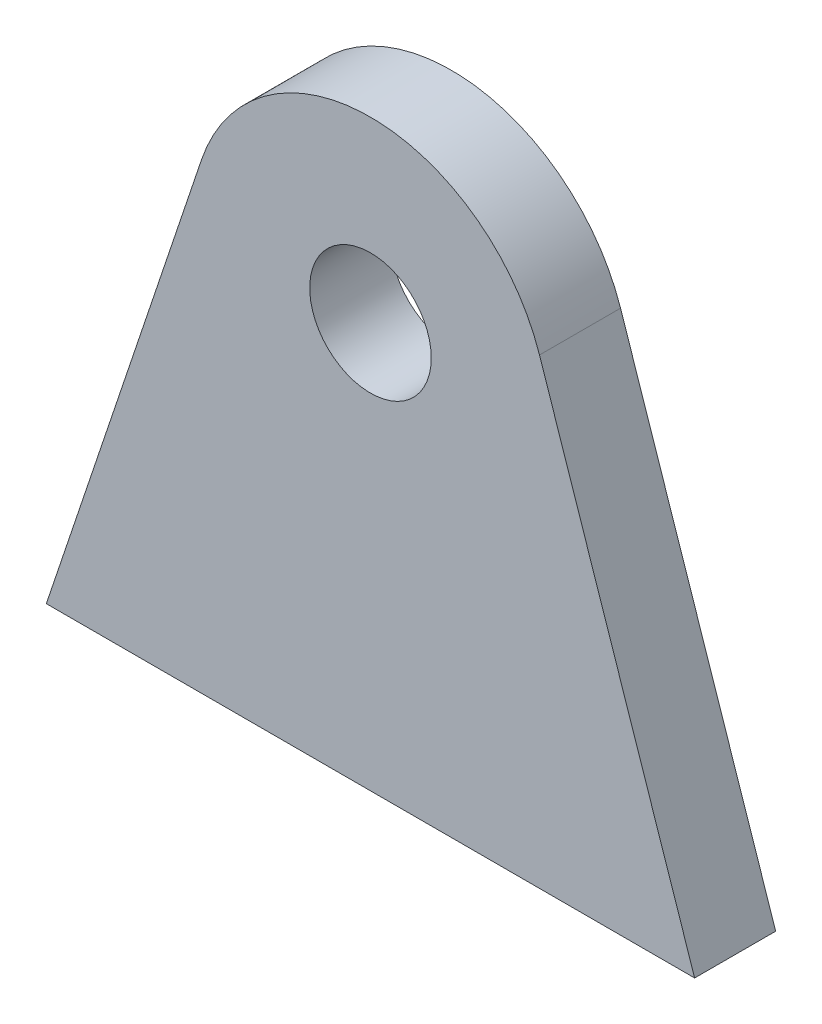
ISO-10303-21;
HEADER;
FILE_DESCRIPTION(('STEP AP214'),'2;1');
FILE_NAME('part.step','',(''),(''),'','','');
FILE_SCHEMA(('AUTOMOTIVE_DESIGN { 1 0 10303 214 1 1 1 1 }'));
ENDSEC;
DATA;
#1=APPLICATION_CONTEXT('core data for automotive mechanical design processes');
#2=APPLICATION_PROTOCOL_DEFINITION('international standard','automotive_design',2000,#1);
#3=PRODUCT_CONTEXT('',#1,'mechanical');
#4=PRODUCT('Part','Part','',(#3));
#5=PRODUCT_RELATED_PRODUCT_CATEGORY('part','',(#4));
#6=PRODUCT_DEFINITION_FORMATION('','',#4);
#7=PRODUCT_DEFINITION_CONTEXT('part definition',#1,'design');
#8=PRODUCT_DEFINITION('design','',#6,#7);
#9=PRODUCT_DEFINITION_SHAPE('','',#8);
#10=(LENGTH_UNIT() NAMED_UNIT(*) SI_UNIT(.MILLI.,.METRE.));
#11=(NAMED_UNIT(*) PLANE_ANGLE_UNIT() SI_UNIT($,.RADIAN.));
#12=(NAMED_UNIT(*) SI_UNIT($,.STERADIAN.) SOLID_ANGLE_UNIT());
#13=UNCERTAINTY_MEASURE_WITH_UNIT(LENGTH_MEASURE(1.E-05),#10,'distance_accuracy_value','');
#14=(GEOMETRIC_REPRESENTATION_CONTEXT(3) GLOBAL_UNCERTAINTY_ASSIGNED_CONTEXT((#13)) GLOBAL_UNIT_ASSIGNED_CONTEXT((#10,
#11,#12)) REPRESENTATION_CONTEXT('',''));
#15=CARTESIAN_POINT('',(0.,0.,0.));
#16=DIRECTION('',(0.,0.,1.));
#17=DIRECTION('',(1.,0.,0.));
#18=AXIS2_PLACEMENT_3D('',#15,#16,#17);
#19=CARTESIAN_POINT('',(25.4,31.75,6.35));
#20=DIRECTION('',(0.,0.,-1.));
#21=DIRECTION('',(-1.,0.,0.));
#22=AXIS2_PLACEMENT_3D('',#19,#20,#21);
#23=PLANE('',#22);
#24=DIRECTION('',(1.,0.,0.));
#25=VECTOR('',#24,1.);
#26=CARTESIAN_POINT('',(50.8,0.,6.35));
#27=LINE('',#26,#25);
#28=CARTESIAN_POINT('',(0.,0.,6.35));
#29=VERTEX_POINT('',#28);
#30=CARTESIAN_POINT('',(50.8,0.,6.35));
#31=VERTEX_POINT('',#30);
#32=EDGE_CURVE('E84',#29,#31,#27,.T.);
#33=ORIENTED_EDGE('',*,*,#32,.T.);
#34=DIRECTION('',(-0.31837254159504,0.9479656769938,0.));
#35=VECTOR('',#34,1.);
#36=CARTESIAN_POINT('',(38.6430805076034,36.1976644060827,6.35));
#37=LINE('',#36,#35);
#38=CARTESIAN_POINT('',(38.6430805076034,36.1976644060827,6.35));
#39=VERTEX_POINT('',#38);
#40=EDGE_CURVE('E79',#31,#39,#37,.T.);
#41=ORIENTED_EDGE('',*,*,#40,.T.);
#42=CARTESIAN_POINT('',(25.4,31.75,6.35));
#43=DIRECTION('',(0.,0.,1.));
#44=DIRECTION('',(-1.,0.,0.));
#45=AXIS2_PLACEMENT_3D('',#42,#43,#44);
#46=CIRCLE('',#45,13.97);
#47=CARTESIAN_POINT('',(12.1569194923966,36.1976644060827,6.35));
#48=VERTEX_POINT('',#47);
#49=EDGE_CURVE('E82',#39,#48,#46,.T.);
#50=ORIENTED_EDGE('',*,*,#49,.T.);
#51=DIRECTION('',(-0.31837254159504,-0.9479656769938,0.));
#52=VECTOR('',#51,1.);
#53=CARTESIAN_POINT('',(0.,0.,6.35));
#54=LINE('',#53,#52);
#55=EDGE_CURVE('E49',#48,#29,#54,.T.);
#56=ORIENTED_EDGE('',*,*,#55,.T.);
#57=EDGE_LOOP('',(#33,#41,#50,#56));
#58=FACE_BOUND('',#57,.T.);
#59=CARTESIAN_POINT('',(25.4,31.75,6.35));
#60=DIRECTION('',(0.,0.,1.));
#61=DIRECTION('',(1.,0.,0.));
#62=AXIS2_PLACEMENT_3D('',#59,#60,#61);
#63=CIRCLE('',#62,4.7625);
#64=CARTESIAN_POINT('',(30.1625,31.75,6.35));
#65=VERTEX_POINT('',#64);
#66=EDGE_CURVE('E99',#65,#65,#63,.T.);
#67=ORIENTED_EDGE('',*,*,#66,.F.);
#68=EDGE_LOOP('',(#67));
#69=FACE_BOUND('',#68,.T.);
#70=ADVANCED_FACE('F32',(#58,#69),#23,.F.);
#71=CARTESIAN_POINT('',(25.4,31.75,0.));
#72=DIRECTION('',(0.,0.,-1.));
#73=DIRECTION('',(-1.,0.,0.));
#74=AXIS2_PLACEMENT_3D('',#71,#72,#73);
#75=PLANE('',#74);
#76=DIRECTION('',(1.,0.,0.));
#77=VECTOR('',#76,1.);
#78=CARTESIAN_POINT('',(50.8,0.,0.));
#79=LINE('',#78,#77);
#80=CARTESIAN_POINT('',(0.,0.,0.));
#81=VERTEX_POINT('',#80);
#82=CARTESIAN_POINT('',(50.8,0.,0.));
#83=VERTEX_POINT('',#82);
#84=EDGE_CURVE('E96',#81,#83,#79,.T.);
#85=ORIENTED_EDGE('',*,*,#84,.F.);
#86=DIRECTION('',(-0.31837254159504,-0.9479656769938,0.));
#87=VECTOR('',#86,1.);
#88=CARTESIAN_POINT('',(0.,0.,0.));
#89=LINE('',#88,#87);
#90=CARTESIAN_POINT('',(12.1569194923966,36.1976644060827,0.));
#91=VERTEX_POINT('',#90);
#92=EDGE_CURVE('E72',#91,#81,#89,.T.);
#93=ORIENTED_EDGE('',*,*,#92,.F.);
#94=CARTESIAN_POINT('',(25.4,31.75,0.));
#95=DIRECTION('',(0.,0.,1.));
#96=DIRECTION('',(-1.,0.,0.));
#97=AXIS2_PLACEMENT_3D('',#94,#95,#96);
#98=CIRCLE('',#97,13.97);
#99=CARTESIAN_POINT('',(38.6430805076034,36.1976644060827,0.));
#100=VERTEX_POINT('',#99);
#101=EDGE_CURVE('E66',#100,#91,#98,.T.);
#102=ORIENTED_EDGE('',*,*,#101,.F.);
#103=DIRECTION('',(-0.31837254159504,0.9479656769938,0.));
#104=VECTOR('',#103,1.);
#105=CARTESIAN_POINT('',(38.6430805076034,36.1976644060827,0.));
#106=LINE('',#105,#104);
#107=EDGE_CURVE('E88',#83,#100,#106,.T.);
#108=ORIENTED_EDGE('',*,*,#107,.F.);
#109=EDGE_LOOP('',(#85,#93,#102,#108));
#110=FACE_BOUND('',#109,.T.);
#111=CARTESIAN_POINT('',(25.4,31.75,0.));
#112=DIRECTION('',(0.,0.,1.));
#113=DIRECTION('',(1.,0.,0.));
#114=AXIS2_PLACEMENT_3D('',#111,#112,#113);
#115=CIRCLE('',#114,4.7625);
#116=CARTESIAN_POINT('',(30.1625,31.75,0.));
#117=VERTEX_POINT('',#116);
#118=EDGE_CURVE('E111',#117,#117,#115,.T.);
#119=ORIENTED_EDGE('',*,*,#118,.T.);
#120=EDGE_LOOP('',(#119));
#121=FACE_BOUND('',#120,.T.);
#122=ADVANCED_FACE('F107',(#110,#121),#75,.T.);
#123=CARTESIAN_POINT('',(50.8,0.,6.35));
#124=DIRECTION('',(0.,1.,0.));
#125=DIRECTION('',(-1.,0.,0.));
#126=AXIS2_PLACEMENT_3D('',#123,#124,#125);
#127=PLANE('',#126);
#128=ORIENTED_EDGE('',*,*,#84,.T.);
#129=DIRECTION('',(0.,0.,-1.));
#130=VECTOR('',#129,1.);
#131=CARTESIAN_POINT('',(50.8,0.,6.35));
#132=LINE('',#131,#130);
#133=EDGE_CURVE('E11',#31,#83,#132,.T.);
#134=ORIENTED_EDGE('',*,*,#133,.F.);
#135=ORIENTED_EDGE('',*,*,#32,.F.);
#136=DIRECTION('',(0.,0.,-1.));
#137=VECTOR('',#136,1.);
#138=CARTESIAN_POINT('',(0.,0.,6.35));
#139=LINE('',#138,#137);
#140=EDGE_CURVE('E92',#29,#81,#139,.T.);
#141=ORIENTED_EDGE('',*,*,#140,.T.);
#142=EDGE_LOOP('',(#128,#134,#135,#141));
#143=FACE_BOUND('',#142,.T.);
#144=ADVANCED_FACE('F34',(#143),#127,.F.);
#145=CARTESIAN_POINT('',(38.6430805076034,36.1976644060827,6.35));
#146=DIRECTION('',(-0.9479656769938,-0.31837254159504,0.));
#147=DIRECTION('',(0.31837254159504,-0.9479656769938,0.));
#148=AXIS2_PLACEMENT_3D('',#145,#146,#147);
#149=PLANE('',#148);
#150=ORIENTED_EDGE('',*,*,#107,.T.);
#151=DIRECTION('',(0.,0.,-1.));
#152=VECTOR('',#151,1.);
#153=CARTESIAN_POINT('',(38.6430805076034,36.1976644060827,6.35));
#154=LINE('',#153,#152);
#155=EDGE_CURVE('E41',#39,#100,#154,.T.);
#156=ORIENTED_EDGE('',*,*,#155,.F.);
#157=ORIENTED_EDGE('',*,*,#40,.F.);
#158=ORIENTED_EDGE('',*,*,#133,.T.);
#159=EDGE_LOOP('',(#150,#156,#157,#158));
#160=FACE_BOUND('',#159,.T.);
#161=ADVANCED_FACE('F87',(#160),#149,.F.);
#162=CARTESIAN_POINT('',(25.4,31.75,6.35));
#163=DIRECTION('',(0.,0.,-1.));
#164=DIRECTION('',(-1.,0.,0.));
#165=AXIS2_PLACEMENT_3D('',#162,#163,#164);
#166=CYLINDRICAL_SURFACE('',#165,13.97);
#167=ORIENTED_EDGE('',*,*,#101,.T.);
#168=DIRECTION('',(0.,0.,-1.));
#169=VECTOR('',#168,1.);
#170=CARTESIAN_POINT('',(12.1569194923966,36.1976644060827,6.35));
#171=LINE('',#170,#169);
#172=EDGE_CURVE('E89',#48,#91,#171,.T.);
#173=ORIENTED_EDGE('',*,*,#172,.F.);
#174=ORIENTED_EDGE('',*,*,#49,.F.);
#175=ORIENTED_EDGE('',*,*,#155,.T.);
#176=EDGE_LOOP('',(#167,#173,#174,#175));
#177=FACE_BOUND('',#176,.T.);
#178=ADVANCED_FACE('F90',(#177),#166,.T.);
#179=CARTESIAN_POINT('',(0.,0.,6.35));
#180=DIRECTION('',(0.9479656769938,-0.31837254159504,0.));
#181=DIRECTION('',(0.31837254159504,0.9479656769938,0.));
#182=AXIS2_PLACEMENT_3D('',#179,#180,#181);
#183=PLANE('',#182);
#184=ORIENTED_EDGE('',*,*,#92,.T.);
#185=ORIENTED_EDGE('',*,*,#140,.F.);
#186=ORIENTED_EDGE('',*,*,#55,.F.);
#187=ORIENTED_EDGE('',*,*,#172,.T.);
#188=EDGE_LOOP('',(#184,#185,#186,#187));
#189=FACE_BOUND('',#188,.T.);
#190=ADVANCED_FACE('F104',(#189),#183,.F.);
#191=CARTESIAN_POINT('',(25.4,31.75,6.35));
#192=DIRECTION('',(0.,0.,-1.));
#193=DIRECTION('',(-1.,0.,0.));
#194=AXIS2_PLACEMENT_3D('',#191,#192,#193);
#195=CYLINDRICAL_SURFACE('',#194,4.7625);
#196=ORIENTED_EDGE('',*,*,#66,.T.);
#197=EDGE_LOOP('',(#196));
#198=FACE_BOUND('',#197,.T.);
#199=ORIENTED_EDGE('',*,*,#118,.F.);
#200=EDGE_LOOP('',(#199));
#201=FACE_BOUND('',#200,.T.);
#202=ADVANCED_FACE('F117',(#198,#201),#195,.F.);
#203=CLOSED_SHELL('',(#70,#122,#144,#161,#178,#190,#202));
#204=MANIFOLD_SOLID_BREP('B2',#203);
#205=ADVANCED_BREP_SHAPE_REPRESENTATION('',(#18,#204),#14);
#206=SHAPE_DEFINITION_REPRESENTATION(#9,#205);
ENDSEC;
END-ISO-10303-21;
